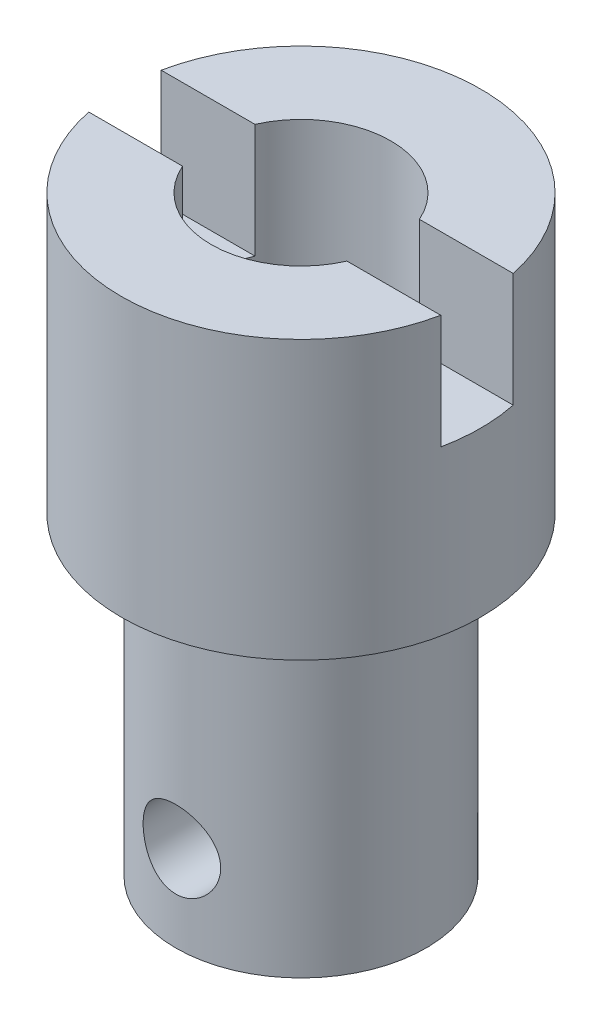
from build123d import *

# Parameters (mm, degrees)
SKETCH2_R                  = 4.0005
EXTRUDE1_DEPTH             = 8.0518
SKETCH3_W                  = 16.002
SKETCH3_H                  = 3.2258
EXTRUDE2_DEPTH             = 5.08
SKETCH4_R                  = 0.79375
EXTRUDE3_DEPTH             = 6.35
F_8_32_TAPPED_HOLE1_REACH  = 29.494
F_8_32_TAPPED_HOLE1_BORE_R = 1.7272


with BuildPart() as part:
    # Sketch1 → Revolve1 (revolve)
    with BuildSketch(Plane.XY, mode=Mode.PRIVATE) as revolve1_sk:
        Polygon((2.00025, 0), (8.001, 0), (8.001, -12.3698), (5.5753, -12.3698), (5.5753, -26.3398), (2.00025, -26.3398), align=None)
    revolve(revolve1_sk.sketch.rotate(Axis((0, 0, 0), (0, -1, 0)), 90), axis=Axis((0, 0, 0), (0, -1, 0)))

    # Sketch2 → Extrude1 (cut)
    with BuildSketch(Plane(origin=(0, 0, 0), x_dir=(1, 0, 0), z_dir=(0, 1, 0))):
        with Locations(Location((0, 0, 0), (0, 0, 270))):
            Circle(SKETCH2_R)
    extrude(amount=-EXTRUDE1_DEPTH, mode=Mode.SUBTRACT)

    # Sketch3 → Extrude2 (cut)
    with BuildSketch(Plane(origin=(0, 0, 0), x_dir=(1, 0, 0), z_dir=(0, 1, 0))):
        Rectangle(SKETCH3_W, SKETCH3_H)
    extrude(amount=-EXTRUDE2_DEPTH, mode=Mode.SUBTRACT)

    # Sketch4 → Extrude3 (cut)
    with BuildSketch(Plane.XZ.offset(12.3698)):
        with Locations(Location((0, 6.858, 0), (0, 0, 270))):
            Circle(SKETCH4_R)
    extrude(amount=-EXTRUDE3_DEPTH, mode=Mode.SUBTRACT)

    # 8-32 Tapped Hole1 bore (on position points) → 8-32 Tapped Hole1 (cut, up to next)
    with BuildSketch(Plane(origin=(0, -22.5298, 5.5753), x_dir=(1, 0, 0), z_dir=(0, 0, 1)), mode=Mode.PRIVATE) as f_8_32_tapped_hole1_sk1:
        Circle(F_8_32_TAPPED_HOLE1_BORE_R)
    f_8_32_tapped_hole1_tool1 = extrude(f_8_32_tapped_hole1_sk1.sketch, amount=-F_8_32_TAPPED_HOLE1_REACH, mode=Mode.PRIVATE) & part.part
    add(f_8_32_tapped_hole1_tool1.solids().sort_by_distance((0, -22.5298, 5.5753))[0], mode=Mode.SUBTRACT)


solid = part.part
